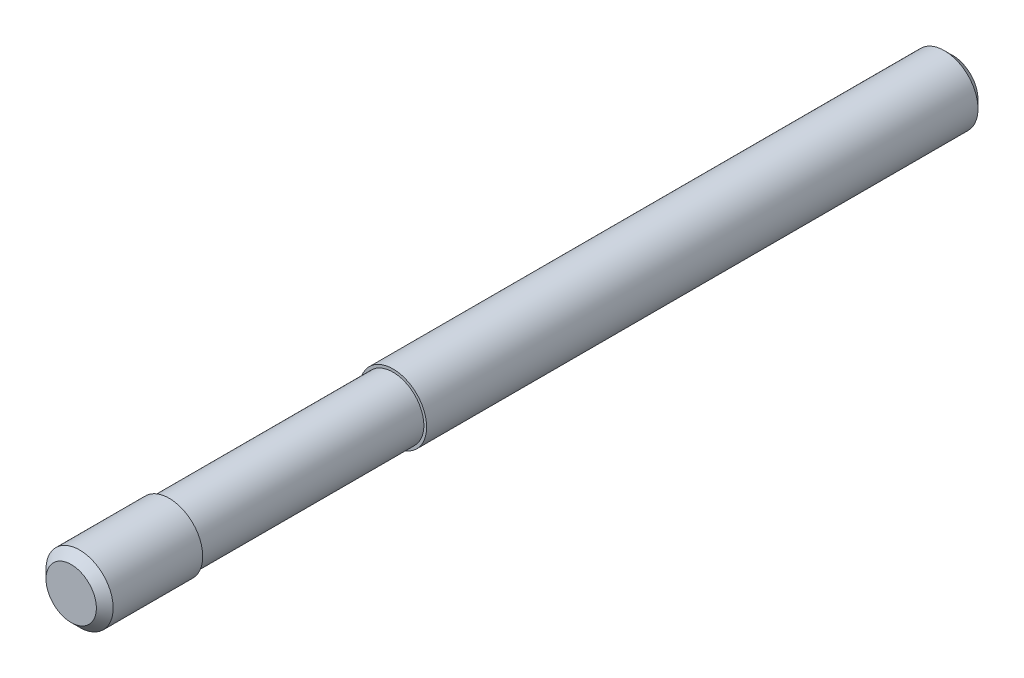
ISO-10303-21;
HEADER;
FILE_DESCRIPTION(('STEP AP214'),'2;1');
FILE_NAME('part.step','',(''),(''),'','','');
FILE_SCHEMA(('AUTOMOTIVE_DESIGN { 1 0 10303 214 1 1 1 1 }'));
ENDSEC;
DATA;
#1=APPLICATION_CONTEXT('core data for automotive mechanical design processes');
#2=APPLICATION_PROTOCOL_DEFINITION('international standard','automotive_design',2000,#1);
#3=PRODUCT_CONTEXT('',#1,'mechanical');
#4=PRODUCT('Part','Part','',(#3));
#5=PRODUCT_RELATED_PRODUCT_CATEGORY('part','',(#4));
#6=PRODUCT_DEFINITION_FORMATION('','',#4);
#7=PRODUCT_DEFINITION_CONTEXT('part definition',#1,'design');
#8=PRODUCT_DEFINITION('design','',#6,#7);
#9=PRODUCT_DEFINITION_SHAPE('','',#8);
#10=(LENGTH_UNIT() NAMED_UNIT(*) SI_UNIT(.MILLI.,.METRE.));
#11=(NAMED_UNIT(*) PLANE_ANGLE_UNIT() SI_UNIT($,.RADIAN.));
#12=(NAMED_UNIT(*) SI_UNIT($,.STERADIAN.) SOLID_ANGLE_UNIT());
#13=UNCERTAINTY_MEASURE_WITH_UNIT(LENGTH_MEASURE(1.E-05),#10,'distance_accuracy_value','');
#14=(GEOMETRIC_REPRESENTATION_CONTEXT(3) GLOBAL_UNCERTAINTY_ASSIGNED_CONTEXT((#13)) GLOBAL_UNIT_ASSIGNED_CONTEXT((#10,
#11,#12)) REPRESENTATION_CONTEXT('',''));
#15=CARTESIAN_POINT('',(0.,0.,0.));
#16=DIRECTION('',(0.,0.,1.));
#17=DIRECTION('',(1.,0.,0.));
#18=AXIS2_PLACEMENT_3D('',#15,#16,#17);
#19=CARTESIAN_POINT('',(-9.,0.,0.));
#20=DIRECTION('',(0.,0.,-1.));
#21=DIRECTION('',(-1.,0.,0.));
#22=AXIS2_PLACEMENT_3D('',#19,#20,#21);
#23=PLANE('',#22);
#24=CARTESIAN_POINT('',(0.,0.,0.));
#25=DIRECTION('',(0.,0.,-1.));
#26=DIRECTION('',(-1.,0.,0.));
#27=AXIS2_PLACEMENT_3D('',#24,#25,#26);
#28=CIRCLE('',#27,9.);
#29=CARTESIAN_POINT('',(-9.,0.,0.));
#30=VERTEX_POINT('',#29);
#31=EDGE_CURVE('E8',#30,#30,#28,.T.);
#32=ORIENTED_EDGE('',*,*,#31,.T.);
#33=EDGE_LOOP('',(#32));
#34=FACE_BOUND('',#33,.T.);
#35=ADVANCED_FACE('F12',(#34),#23,.T.);
#36=CARTESIAN_POINT('',(0.,0.,0.));
#37=DIRECTION('',(0.,0.,1.));
#38=DIRECTION('',(1.,0.,0.));
#39=AXIS2_PLACEMENT_3D('',#36,#37,#38);
#40=CONICAL_SURFACE('',#39,9.,0.785398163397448);
#41=CARTESIAN_POINT('',(0.,0.,3.));
#42=DIRECTION('',(0.,0.,-1.));
#43=DIRECTION('',(-1.,0.,0.));
#44=AXIS2_PLACEMENT_3D('',#41,#42,#43);
#45=CIRCLE('',#44,12.);
#46=CARTESIAN_POINT('',(-12.,0.,3.));
#47=VERTEX_POINT('',#46);
#48=EDGE_CURVE('E18',#47,#47,#45,.T.);
#49=ORIENTED_EDGE('',*,*,#48,.T.);
#50=EDGE_LOOP('',(#49));
#51=FACE_BOUND('',#50,.T.);
#52=ORIENTED_EDGE('',*,*,#31,.F.);
#53=EDGE_LOOP('',(#52));
#54=FACE_BOUND('',#53,.T.);
#55=ADVANCED_FACE('F57',(#51,#54),#40,.T.);
#56=CARTESIAN_POINT('',(0.,0.,0.));
#57=DIRECTION('',(0.,0.,-1.));
#58=DIRECTION('',(-1.,0.,0.));
#59=AXIS2_PLACEMENT_3D('',#56,#57,#58);
#60=CYLINDRICAL_SURFACE('',#59,12.);
#61=CARTESIAN_POINT('',(0.,0.,200.));
#62=DIRECTION('',(0.,0.,-1.));
#63=DIRECTION('',(-1.,0.,0.));
#64=AXIS2_PLACEMENT_3D('',#61,#62,#63);
#65=CIRCLE('',#64,12.);
#66=CARTESIAN_POINT('',(-12.,0.,200.));
#67=VERTEX_POINT('',#66);
#68=EDGE_CURVE('E22',#67,#67,#65,.T.);
#69=ORIENTED_EDGE('',*,*,#68,.T.);
#70=EDGE_LOOP('',(#69));
#71=FACE_BOUND('',#70,.T.);
#72=ORIENTED_EDGE('',*,*,#48,.F.);
#73=EDGE_LOOP('',(#72));
#74=FACE_BOUND('',#73,.T.);
#75=ADVANCED_FACE('F61',(#71,#74),#60,.T.);
#76=CARTESIAN_POINT('',(-11.,0.,200.));
#77=DIRECTION('',(0.,0.,1.));
#78=DIRECTION('',(1.,0.,0.));
#79=AXIS2_PLACEMENT_3D('',#76,#77,#78);
#80=PLANE('',#79);
#81=CARTESIAN_POINT('',(0.,0.,200.));
#82=DIRECTION('',(0.,0.,-1.));
#83=DIRECTION('',(-1.,0.,0.));
#84=AXIS2_PLACEMENT_3D('',#81,#82,#83);
#85=CIRCLE('',#84,11.);
#86=CARTESIAN_POINT('',(-11.,0.,200.));
#87=VERTEX_POINT('',#86);
#88=EDGE_CURVE('E26',#87,#87,#85,.T.);
#89=ORIENTED_EDGE('',*,*,#88,.T.);
#90=EDGE_LOOP('',(#89));
#91=FACE_BOUND('',#90,.T.);
#92=ORIENTED_EDGE('',*,*,#68,.F.);
#93=EDGE_LOOP('',(#92));
#94=FACE_BOUND('',#93,.T.);
#95=ADVANCED_FACE('F65',(#91,#94),#80,.T.);
#96=CARTESIAN_POINT('',(0.,0.,0.));
#97=DIRECTION('',(0.,0.,-1.));
#98=DIRECTION('',(-1.,0.,0.));
#99=AXIS2_PLACEMENT_3D('',#96,#97,#98);
#100=CYLINDRICAL_SURFACE('',#99,11.);
#101=CARTESIAN_POINT('',(0.,0.,280.));
#102=DIRECTION('',(0.,0.,-1.));
#103=DIRECTION('',(-1.,0.,0.));
#104=AXIS2_PLACEMENT_3D('',#101,#102,#103);
#105=CIRCLE('',#104,11.);
#106=CARTESIAN_POINT('',(-11.,0.,280.));
#107=VERTEX_POINT('',#106);
#108=EDGE_CURVE('E31',#107,#107,#105,.T.);
#109=ORIENTED_EDGE('',*,*,#108,.T.);
#110=EDGE_LOOP('',(#109));
#111=FACE_BOUND('',#110,.T.);
#112=ORIENTED_EDGE('',*,*,#88,.F.);
#113=EDGE_LOOP('',(#112));
#114=FACE_BOUND('',#113,.T.);
#115=ADVANCED_FACE('F72',(#111,#114),#100,.T.);
#116=CARTESIAN_POINT('',(-12.,0.,280.));
#117=DIRECTION('',(0.,0.,-1.));
#118=DIRECTION('',(-1.,0.,0.));
#119=AXIS2_PLACEMENT_3D('',#116,#117,#118);
#120=PLANE('',#119);
#121=CARTESIAN_POINT('',(0.,0.,280.));
#122=DIRECTION('',(0.,0.,-1.));
#123=DIRECTION('',(-1.,0.,0.));
#124=AXIS2_PLACEMENT_3D('',#121,#122,#123);
#125=CIRCLE('',#124,12.);
#126=CARTESIAN_POINT('',(-12.,0.,280.));
#127=VERTEX_POINT('',#126);
#128=EDGE_CURVE('E34',#127,#127,#125,.T.);
#129=ORIENTED_EDGE('',*,*,#128,.T.);
#130=EDGE_LOOP('',(#129));
#131=FACE_BOUND('',#130,.T.);
#132=ORIENTED_EDGE('',*,*,#108,.F.);
#133=EDGE_LOOP('',(#132));
#134=FACE_BOUND('',#133,.T.);
#135=ADVANCED_FACE('F76',(#131,#134),#120,.T.);
#136=CARTESIAN_POINT('',(0.,0.,0.));
#137=DIRECTION('',(0.,0.,-1.));
#138=DIRECTION('',(-1.,0.,0.));
#139=AXIS2_PLACEMENT_3D('',#136,#137,#138);
#140=CYLINDRICAL_SURFACE('',#139,12.);
#141=CARTESIAN_POINT('',(0.,0.,312.));
#142=DIRECTION('',(0.,0.,-1.));
#143=DIRECTION('',(-1.,0.,0.));
#144=AXIS2_PLACEMENT_3D('',#141,#142,#143);
#145=CIRCLE('',#144,12.);
#146=CARTESIAN_POINT('',(-12.,0.,312.));
#147=VERTEX_POINT('',#146);
#148=EDGE_CURVE('E37',#147,#147,#145,.T.);
#149=ORIENTED_EDGE('',*,*,#148,.T.);
#150=EDGE_LOOP('',(#149));
#151=FACE_BOUND('',#150,.T.);
#152=ORIENTED_EDGE('',*,*,#128,.F.);
#153=EDGE_LOOP('',(#152));
#154=FACE_BOUND('',#153,.T.);
#155=ADVANCED_FACE('F54',(#151,#154),#140,.T.);
#156=CARTESIAN_POINT('',(0.,0.,312.));
#157=DIRECTION('',(0.,0.,-1.));
#158=DIRECTION('',(-1.,0.,0.));
#159=AXIS2_PLACEMENT_3D('',#156,#157,#158);
#160=CONICAL_SURFACE('',#159,12.,0.785398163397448);
#161=CARTESIAN_POINT('',(0.,0.,315.));
#162=DIRECTION('',(0.,0.,-1.));
#163=DIRECTION('',(-1.,0.,0.));
#164=AXIS2_PLACEMENT_3D('',#161,#162,#163);
#165=CIRCLE('',#164,9.);
#166=CARTESIAN_POINT('',(-9.,0.,315.));
#167=VERTEX_POINT('',#166);
#168=EDGE_CURVE('E40',#167,#167,#165,.T.);
#169=ORIENTED_EDGE('',*,*,#168,.T.);
#170=EDGE_LOOP('',(#169));
#171=FACE_BOUND('',#170,.T.);
#172=ORIENTED_EDGE('',*,*,#148,.F.);
#173=EDGE_LOOP('',(#172));
#174=FACE_BOUND('',#173,.T.);
#175=ADVANCED_FACE('F44',(#171,#174),#160,.T.);
#176=CARTESIAN_POINT('',(0.,0.,315.));
#177=DIRECTION('',(0.,0.,1.));
#178=DIRECTION('',(1.,0.,0.));
#179=AXIS2_PLACEMENT_3D('',#176,#177,#178);
#180=PLANE('',#179);
#181=ORIENTED_EDGE('',*,*,#168,.F.);
#182=EDGE_LOOP('',(#181));
#183=FACE_BOUND('',#182,.T.);
#184=ADVANCED_FACE('F47',(#183),#180,.T.);
#185=CLOSED_SHELL('',(#35,#55,#75,#95,#115,#135,#155,#175,#184));
#186=MANIFOLD_SOLID_BREP('B1',#185);
#187=ADVANCED_BREP_SHAPE_REPRESENTATION('',(#18,#186),#14);
#188=SHAPE_DEFINITION_REPRESENTATION(#9,#187);
ENDSEC;
END-ISO-10303-21;
